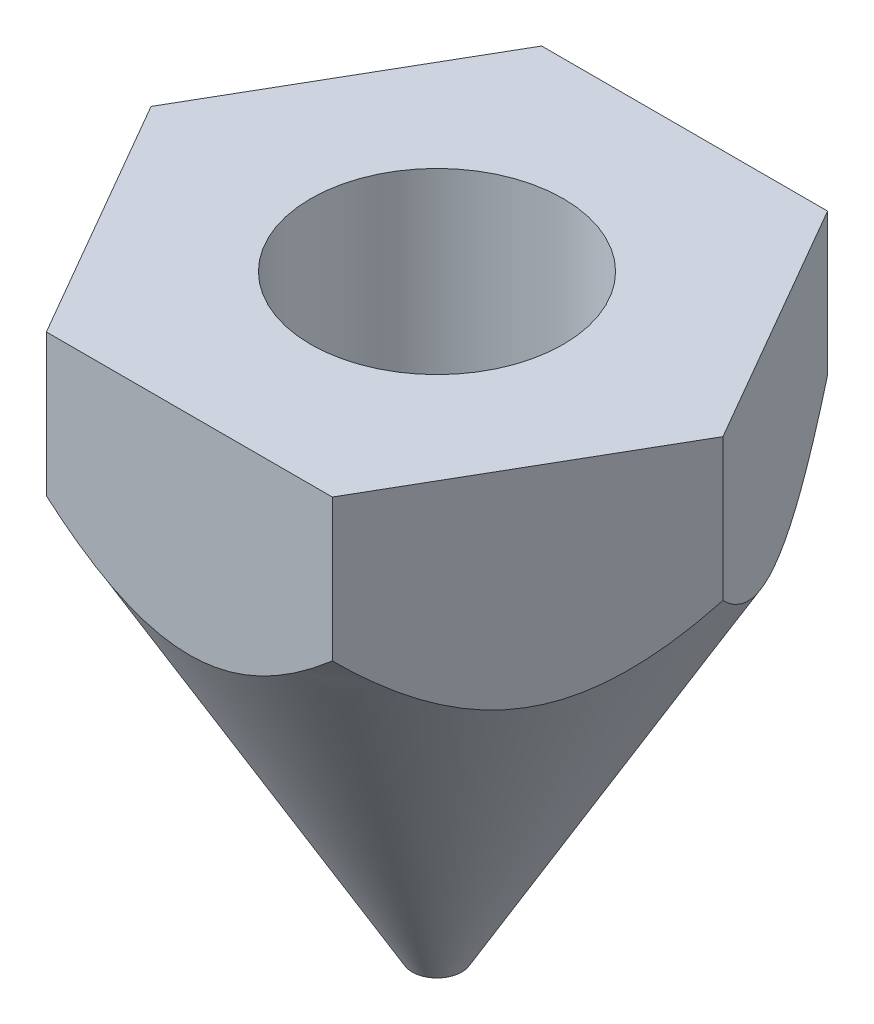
ISO-10303-21;
HEADER;
FILE_DESCRIPTION(('STEP AP214'),'2;1');
FILE_NAME('part.step','',(''),(''),'','','');
FILE_SCHEMA(('AUTOMOTIVE_DESIGN { 1 0 10303 214 1 1 1 1 }'));
ENDSEC;
DATA;
#1=APPLICATION_CONTEXT('core data for automotive mechanical design processes');
#2=APPLICATION_PROTOCOL_DEFINITION('international standard','automotive_design',2000,#1);
#3=PRODUCT_CONTEXT('',#1,'mechanical');
#4=PRODUCT('Part','Part','',(#3));
#5=PRODUCT_RELATED_PRODUCT_CATEGORY('part','',(#4));
#6=PRODUCT_DEFINITION_FORMATION('','',#4);
#7=PRODUCT_DEFINITION_CONTEXT('part definition',#1,'design');
#8=PRODUCT_DEFINITION('design','',#6,#7);
#9=PRODUCT_DEFINITION_SHAPE('','',#8);
#10=(LENGTH_UNIT() NAMED_UNIT(*) SI_UNIT(.MILLI.,.METRE.));
#11=(NAMED_UNIT(*) PLANE_ANGLE_UNIT() SI_UNIT($,.RADIAN.));
#12=(NAMED_UNIT(*) SI_UNIT($,.STERADIAN.) SOLID_ANGLE_UNIT());
#13=UNCERTAINTY_MEASURE_WITH_UNIT(LENGTH_MEASURE(1.E-05),#10,'distance_accuracy_value','');
#14=(GEOMETRIC_REPRESENTATION_CONTEXT(3) GLOBAL_UNCERTAINTY_ASSIGNED_CONTEXT((#13)) GLOBAL_UNIT_ASSIGNED_CONTEXT((#10,
#11,#12)) REPRESENTATION_CONTEXT('',''));
#15=CARTESIAN_POINT('',(0.,0.,0.));
#16=DIRECTION('',(0.,0.,1.));
#17=DIRECTION('',(1.,0.,0.));
#18=AXIS2_PLACEMENT_3D('',#15,#16,#17);
#19=CARTESIAN_POINT('',(0.,-0.527756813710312,0.));
#20=DIRECTION('',(0.,1.,0.));
#21=DIRECTION('',(0.,0.,1.));
#22=AXIS2_PLACEMENT_3D('',#19,#20,#21);
#23=CONICAL_SURFACE('',#22,2.54999999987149,1.04719755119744);
#24=CARTESIAN_POINT('',(0.,-1.884529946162,0.));
#25=DIRECTION('',(0.,1.,0.));
#26=DIRECTION('',(0.,0.,1.));
#27=AXIS2_PLACEMENT_3D('',#24,#25,#26);
#28=CIRCLE('',#27,0.2);
#29=CARTESIAN_POINT('',(0.,-1.884529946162,0.200000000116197));
#30=VERTEX_POINT('',#29);
#31=EDGE_CURVE('E156',#30,#30,#28,.F.);
#32=CARTESIAN_POINT('',(0.,-0.5277568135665,0.));
#33=DIRECTION('',(0.,1.,0.));
#34=DIRECTION('',(0.,0.,1.));
#35=AXIS2_PLACEMENT_3D('',#32,#33,#34);
#36=CIRCLE('',#35,2.55);
#37=CARTESIAN_POINT('',(0.,-0.5277568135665,2.55000000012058));
#38=VERTEX_POINT('',#37);
#39=EDGE_CURVE('E160',#38,#38,#36,.T.);
#40=CARTESIAN_POINT('',(0.,-1.884529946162,0.200000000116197));
#41=CARTESIAN_POINT('',(0.,-1.87039689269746,0.224479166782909));
#42=CARTESIAN_POINT('',(0.,-1.85626383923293,0.248958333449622));
#43=CARTESIAN_POINT('',(0.,-1.82799773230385,0.297916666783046));
#44=CARTESIAN_POINT('',(0.,-1.81386467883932,0.322395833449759));
#45=CARTESIAN_POINT('',(0.,-1.78559857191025,0.371354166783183));
#46=CARTESIAN_POINT('',(0.,-1.77146551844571,0.395833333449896));
#47=CARTESIAN_POINT('',(0.,-1.74319941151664,0.44479166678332));
#48=CARTESIAN_POINT('',(0.,-1.7290663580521,0.469270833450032));
#49=CARTESIAN_POINT('',(0.,-1.70080025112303,0.518229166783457));
#50=CARTESIAN_POINT('',(0.,-1.68666719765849,0.542708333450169));
#51=CARTESIAN_POINT('',(0.,-1.65840109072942,0.591666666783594));
#52=CARTESIAN_POINT('',(0.,-1.64426803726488,0.616145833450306));
#53=CARTESIAN_POINT('',(0.,-1.61600193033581,0.665104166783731));
#54=CARTESIAN_POINT('',(0.,-1.60186887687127,0.689583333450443));
#55=CARTESIAN_POINT('',(0.,-1.5736027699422,0.738541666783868));
#56=CARTESIAN_POINT('',(0.,-1.55946971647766,0.76302083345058));
#57=CARTESIAN_POINT('',(0.,-1.53120360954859,0.811979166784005));
#58=CARTESIAN_POINT('',(0.,-1.51707055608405,0.836458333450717));
#59=CARTESIAN_POINT('',(0.,-1.48880444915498,0.885416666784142));
#60=CARTESIAN_POINT('',(0.,-1.47467139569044,0.909895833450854));
#61=CARTESIAN_POINT('',(0.,-1.44640528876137,0.958854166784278));
#62=CARTESIAN_POINT('',(0.,-1.43227223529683,0.983333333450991));
#63=CARTESIAN_POINT('',(0.,-1.40400612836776,1.03229166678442));
#64=CARTESIAN_POINT('',(0.,-1.38987307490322,1.05677083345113));
#65=CARTESIAN_POINT('',(0.,-1.36160696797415,1.10572916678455));
#66=CARTESIAN_POINT('',(0.,-1.34747391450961,1.13020833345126));
#67=CARTESIAN_POINT('',(0.,-1.31920780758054,1.17916666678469));
#68=CARTESIAN_POINT('',(0.,-1.30507475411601,1.2036458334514));
#69=CARTESIAN_POINT('',(0.,-1.27680864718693,1.25260416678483));
#70=CARTESIAN_POINT('',(0.,-1.2626755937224,1.27708333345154));
#71=CARTESIAN_POINT('',(0.,-1.23440948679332,1.32604166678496));
#72=CARTESIAN_POINT('',(0.,-1.22027643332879,1.35052083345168));
#73=CARTESIAN_POINT('',(0.,-1.19201032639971,1.3994791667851));
#74=CARTESIAN_POINT('',(0.,-1.17787727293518,1.42395833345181));
#75=CARTESIAN_POINT('',(0.,-1.1496111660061,1.47291666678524));
#76=CARTESIAN_POINT('',(0.,-1.13547811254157,1.49739583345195));
#77=CARTESIAN_POINT('',(0.,-1.10721200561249,1.54635416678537));
#78=CARTESIAN_POINT('',(0.,-1.09307895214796,1.57083333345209));
#79=CARTESIAN_POINT('',(0.,-1.06481284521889,1.61979166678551));
#80=CARTESIAN_POINT('',(0.,-1.05067979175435,1.64427083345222));
#81=CARTESIAN_POINT('',(0.,-1.02241368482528,1.69322916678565));
#82=CARTESIAN_POINT('',(0.,-1.00828063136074,1.71770833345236));
#83=CARTESIAN_POINT('',(0.,-0.980014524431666,1.76666666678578));
#84=CARTESIAN_POINT('',(0.,-0.96588147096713,1.7911458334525));
#85=CARTESIAN_POINT('',(0.,-0.937615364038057,1.84010416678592));
#86=CARTESIAN_POINT('',(0.,-0.923482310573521,1.86458333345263));
#87=CARTESIAN_POINT('',(0.,-0.895216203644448,1.91354166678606));
#88=CARTESIAN_POINT('',(0.,-0.881083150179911,1.93802083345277));
#89=CARTESIAN_POINT('',(0.,-0.852817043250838,1.9869791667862));
#90=CARTESIAN_POINT('',(0.,-0.838683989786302,2.01145833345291));
#91=CARTESIAN_POINT('',(0.,-0.810417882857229,2.06041666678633));
#92=CARTESIAN_POINT('',(0.,-0.796284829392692,2.08489583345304));
#93=CARTESIAN_POINT('',(0.,-0.768018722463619,2.13385416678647));
#94=CARTESIAN_POINT('',(0.,-0.753885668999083,2.15833333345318));
#95=CARTESIAN_POINT('',(0.,-0.72561956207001,2.20729166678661));
#96=CARTESIAN_POINT('',(0.,-0.711486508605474,2.23177083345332));
#97=CARTESIAN_POINT('',(0.,-0.683220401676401,2.28072916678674));
#98=CARTESIAN_POINT('',(0.,-0.669087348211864,2.30520833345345));
#99=CARTESIAN_POINT('',(0.,-0.640821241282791,2.35416666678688));
#100=CARTESIAN_POINT('',(0.,-0.626688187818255,2.37864583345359));
#101=CARTESIAN_POINT('',(0.,-0.598422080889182,2.42760416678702));
#102=CARTESIAN_POINT('',(0.,-0.584289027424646,2.45208333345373));
#103=CARTESIAN_POINT('',(0.,-0.556022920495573,2.50104166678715));
#104=CARTESIAN_POINT('',(0.,-0.541889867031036,2.52552083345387));
#105=CARTESIAN_POINT('',(0.,-0.5277568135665,2.55000000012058));
#106=B_SPLINE_CURVE_WITH_KNOTS('',3,(#40,#41,#42,#43,#44,#45,#46,#47,#48,#49,#50,#51,#52,#53,
#54,#55,#56,#57,#58,#59,#60,#61,#62,#63,#64,#65,#66,#67,#68,#69,#70,#71,#72,#73,#74,#75,#76,#77,
#78,#79,#80,#81,#82,#83,#84,#85,#86,#87,#88,#89,#90,#91,#92,#93,#94,#95,#96,#97,#98,#99,#100,
#101,#102,#103,#104,#105),.UNSPECIFIED.,.F.,.F.,(4,2,2,2,2,2,2,2,2,2,2,2,2,2,2,2,2,2,2,2,2,2,2,
2,2,2,2,2,2,2,2,2,4),(0.,0.0847983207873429,0.169596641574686,0.254394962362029,
0.339193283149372,0.423991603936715,0.508789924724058,0.593588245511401,0.678386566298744,
0.763184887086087,0.84798320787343,0.932781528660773,1.01757984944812,1.10237817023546,
1.1871764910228,1.27197481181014,1.35677313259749,1.44157145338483,1.52636977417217,
1.61116809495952,1.69596641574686,1.7807647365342,1.86556305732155,1.95036137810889,
2.03515969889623,2.11995801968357,2.20475634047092,2.28955466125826,2.3743529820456,
2.45915130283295,2.54394962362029,2.62874794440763,2.71354626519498),.UNSPECIFIED.);
#107=EDGE_CURVE('BSEAM17',#30,#38,#106,.T.);
#108=ORIENTED_EDGE('',*,*,#31,.T.);
#109=ORIENTED_EDGE('',*,*,#39,.T.);
#110=ORIENTED_EDGE('',*,*,#107,.T.);
#111=ORIENTED_EDGE('',*,*,#107,.F.);
#112=EDGE_LOOP('',(#108,#110,#109,#111));
#113=FACE_BOUND('',#112,.T.);
#114=ADVANCED_FACE('F17',(#113),#23,.F.);
#115=CARTESIAN_POINT('',(0.,-6.6,0.));
#116=DIRECTION('',(0.,1.,0.));
#117=DIRECTION('',(0.,0.,1.));
#118=AXIS2_PLACEMENT_3D('',#115,#116,#117);
#119=CYLINDRICAL_SURFACE('',#118,2.55);
#120=ORIENTED_EDGE('',*,*,#39,.F.);
#121=EDGE_LOOP('',(#120));
#122=FACE_BOUND('',#121,.T.);
#123=CARTESIAN_POINT('',(0.,6.,0.));
#124=DIRECTION('',(0.,1.,0.));
#125=DIRECTION('',(0.,0.,1.));
#126=AXIS2_PLACEMENT_3D('',#123,#124,#125);
#127=CIRCLE('',#126,2.55);
#128=CARTESIAN_POINT('',(0.,6.,2.55));
#129=VERTEX_POINT('',#128);
#130=EDGE_CURVE('E20',#129,#129,#127,.F.);
#131=ORIENTED_EDGE('',*,*,#130,.F.);
#132=EDGE_LOOP('',(#131));
#133=FACE_BOUND('',#132,.T.);
#134=ADVANCED_FACE('F250',(#122,#133),#119,.F.);
#135=CARTESIAN_POINT('',(0.,6.,0.));
#136=DIRECTION('',(0.,1.,0.));
#137=DIRECTION('',(0.,0.,1.));
#138=AXIS2_PLACEMENT_3D('',#135,#136,#137);
#139=PLANE('',#138);
#140=ORIENTED_EDGE('',*,*,#130,.T.);
#141=EDGE_LOOP('',(#140));
#142=FACE_BOUND('',#141,.T.);
#143=DIRECTION('',(1.,0.,0.));
#144=VECTOR('',#143,1.);
#145=CARTESIAN_POINT('',(-2.886751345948,6.,5.));
#146=LINE('',#145,#144);
#147=CARTESIAN_POINT('',(2.886751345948,6.,5.));
#148=VERTEX_POINT('',#147);
#149=CARTESIAN_POINT('',(-2.88675134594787,6.,4.99999999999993));
#150=VERTEX_POINT('',#149);
#151=EDGE_CURVE('E81',#148,#150,#146,.F.);
#152=ORIENTED_EDGE('',*,*,#151,.F.);
#153=DIRECTION('',(0.500000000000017,0.,-0.866025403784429));
#154=VECTOR('',#153,1.);
#155=CARTESIAN_POINT('',(2.886751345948,6.,5.));
#156=LINE('',#155,#154);
#157=CARTESIAN_POINT('',(5.77350269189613,6.,0.));
#158=VERTEX_POINT('',#157);
#159=EDGE_CURVE('E117',#158,#148,#156,.F.);
#160=ORIENTED_EDGE('',*,*,#159,.F.);
#161=DIRECTION('',(-0.500000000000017,0.,-0.866025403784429));
#162=VECTOR('',#161,1.);
#163=CARTESIAN_POINT('',(5.773502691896,6.,0.));
#164=LINE('',#163,#162);
#165=CARTESIAN_POINT('',(2.88675134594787,6.,-4.99999999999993));
#166=VERTEX_POINT('',#165);
#167=EDGE_CURVE('E124',#166,#158,#164,.F.);
#168=ORIENTED_EDGE('',*,*,#167,.F.);
#169=DIRECTION('',(-1.,0.,0.));
#170=VECTOR('',#169,1.);
#171=CARTESIAN_POINT('',(2.886751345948,6.,-5.));
#172=LINE('',#171,#170);
#173=CARTESIAN_POINT('',(-2.886751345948,6.,-5.));
#174=VERTEX_POINT('',#173);
#175=EDGE_CURVE('E131',#174,#166,#172,.F.);
#176=ORIENTED_EDGE('',*,*,#175,.F.);
#177=DIRECTION('',(-0.500000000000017,0.,0.866025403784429));
#178=VECTOR('',#177,1.);
#179=CARTESIAN_POINT('',(-2.886751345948,6.,-5.));
#180=LINE('',#179,#178);
#181=CARTESIAN_POINT('',(-5.77350269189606,6.,0.));
#182=VERTEX_POINT('',#181);
#183=EDGE_CURVE('E97',#182,#174,#180,.F.);
#184=ORIENTED_EDGE('',*,*,#183,.F.);
#185=DIRECTION('',(0.500000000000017,0.,0.866025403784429));
#186=VECTOR('',#185,1.);
#187=CARTESIAN_POINT('',(-5.773502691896,6.,0.));
#188=LINE('',#187,#186);
#189=EDGE_CURVE('E94',#150,#182,#188,.F.);
#190=ORIENTED_EDGE('',*,*,#189,.F.);
#191=EDGE_LOOP('',(#152,#160,#168,#176,#184,#190));
#192=FACE_BOUND('',#191,.T.);
#193=ADVANCED_FACE('F95',(#142,#192),#139,.T.);
#194=CARTESIAN_POINT('',(-2.886751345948,-6.,-5.));
#195=DIRECTION('',(-0.866025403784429,0.,-0.500000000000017));
#196=DIRECTION('',(-0.500000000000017,0.,0.866025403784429));
#197=AXIS2_PLACEMENT_3D('',#194,#195,#196);
#198=PLANE('',#197);
#199=DIRECTION('',(0.,1.,0.));
#200=VECTOR('',#199,1.);
#201=CARTESIAN_POINT('',(-2.886751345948,-6.,-5.));
#202=LINE('',#201,#200);
#203=CARTESIAN_POINT('',(-2.88675133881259,3.13397458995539,-5.));
#204=VERTEX_POINT('',#203);
#205=EDGE_CURVE('E134',#204,#174,#202,.T.);
#206=ORIENTED_EDGE('',*,*,#205,.F.);
#207=CARTESIAN_POINT('',(-5.77350269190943,3.13397459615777,2.28181177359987E-11));
#208=CARTESIAN_POINT('',(-5.74330935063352,3.08168355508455,-0.052296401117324));
#209=CARTESIAN_POINT('',(-5.7128147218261,3.0300900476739,-0.105114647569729));
#210=CARTESIAN_POINT('',(-5.65115657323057,2.92849255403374,-0.211909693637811));
#211=CARTESIAN_POINT('',(-5.6199928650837,2.8784890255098,-0.265886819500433));
#212=CARTESIAN_POINT('',(-5.52510355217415,2.73069937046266,-0.430239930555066));
#213=CARTESIAN_POINT('',(-5.46028621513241,2.63567137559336,-0.542506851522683));
#214=CARTESIAN_POINT('',(-5.32560574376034,2.45301125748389,-0.775780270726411));
#215=CARTESIAN_POINT('',(-5.25565551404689,2.36563362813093,-0.896937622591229));
#216=CARTESIAN_POINT('',(-5.11196574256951,2.20480810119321,-1.145815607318));
#217=CARTESIAN_POINT('',(-5.0382350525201,2.13132939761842,-1.27352090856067));
#218=CARTESIAN_POINT('',(-4.92137749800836,2.03205360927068,-1.47592413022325));
#219=CARTESIAN_POINT('',(-4.87961849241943,1.99978832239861,-1.54825284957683));
#220=CARTESIAN_POINT('',(-4.7950069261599,1.94151345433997,-1.69480438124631));
#221=CARTESIAN_POINT('',(-4.75215428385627,1.91550434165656,-1.76902733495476));
#222=CARTESIAN_POINT('',(-4.66586691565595,1.87073618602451,-1.91848144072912));
#223=CARTESIAN_POINT('',(-4.62243948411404,1.85192137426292,-1.99369995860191));
#224=CARTESIAN_POINT('',(-4.53493131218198,1.82193201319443,-2.14526855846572));
#225=CARTESIAN_POINT('',(-4.49085069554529,1.81075603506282,-2.22161842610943));
#226=CARTESIAN_POINT('',(-4.40195182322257,1.79642450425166,-2.37559578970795));
#227=CARTESIAN_POINT('',(-4.35713051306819,1.79334377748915,-2.45322857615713));
#228=CARTESIAN_POINT('',(-4.26754050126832,1.79555209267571,-2.6084030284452));
#229=CARTESIAN_POINT('',(-4.22277179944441,1.80084110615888,-2.68594469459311));
#230=CARTESIAN_POINT('',(-4.13356920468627,1.81958218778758,-2.84044812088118));
#231=CARTESIAN_POINT('',(-4.08913625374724,1.83305201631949,-2.91740824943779));
#232=CARTESIAN_POINT('',(-4.00100294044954,1.86763566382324,-3.07005962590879));
#233=CARTESIAN_POINT('',(-3.95730303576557,1.88875408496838,-3.14575008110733));
#234=CARTESIAN_POINT('',(-3.85841334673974,1.94498899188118,-3.31703204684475));
#235=CARTESIAN_POINT('',(-3.80354801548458,1.98238645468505,-3.41206158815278));
#236=CARTESIAN_POINT('',(-3.69570905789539,2.06687223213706,-3.59884414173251));
#237=CARTESIAN_POINT('',(-3.64273662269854,2.11396652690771,-3.6905950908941));
#238=CARTESIAN_POINT('',(-3.53855459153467,2.21631839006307,-3.87104366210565));
#239=CARTESIAN_POINT('',(-3.48735296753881,2.27160811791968,-3.95972747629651));
#240=CARTESIAN_POINT('',(-3.38687589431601,2.38869359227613,-4.13375887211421));
#241=CARTESIAN_POINT('',(-3.33760012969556,2.45048826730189,-4.21910700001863));
#242=CARTESIAN_POINT('',(-3.21831893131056,2.60930689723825,-4.42570809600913));
#243=CARTESIAN_POINT('',(-3.14932143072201,2.70935748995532,-4.54521527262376));
#244=CARTESIAN_POINT('',(-3.04867290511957,2.86510463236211,-4.71954363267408));
#245=CARTESIAN_POINT('',(-3.01577602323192,2.91765297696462,-4.77652270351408));
#246=CARTESIAN_POINT('',(-2.95072554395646,3.02453389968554,-4.88919343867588));
#247=CARTESIAN_POINT('',(-2.91857179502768,3.07886610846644,-4.94488536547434));
#248=CARTESIAN_POINT('',(-2.88675137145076,3.13397455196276,-4.99999995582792));
#249=B_SPLINE_CURVE_WITH_KNOTS('',3,(#207,#208,#209,#210,#211,#212,#213,#214,#215,#216,#217,
#218,#219,#220,#221,#222,#223,#224,#225,#226,#227,#228,#229,#230,#231,#232,#233,#234,#235,#236,
#237,#238,#239,#240,#241,#242,#243,#244,#245,#246,#247,#248),.UNSPECIFIED.,.F.,.F.,(4,2,2,2,2,2,
2,2,2,2,2,2,2,2,2,2,2,2,2,2,4),(0.,0.239630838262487,0.479330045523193,0.961170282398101,
1.4554586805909,1.94863834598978,2.21703664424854,2.48545503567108,2.75174834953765,
3.01799184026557,3.28668775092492,3.55538274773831,3.82466317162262,4.09410589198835,
4.44132290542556,4.78875469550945,5.13758781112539,5.48636355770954,5.99721680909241,
6.2498047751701,6.50234077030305),.UNSPECIFIED.);
#250=CARTESIAN_POINT('',(-5.77350269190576,3.13397459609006,0.));
#251=VERTEX_POINT('',#250);
#252=EDGE_CURVE('E39',#251,#204,#249,.T.);
#253=ORIENTED_EDGE('',*,*,#252,.F.);
#254=DIRECTION('',(0.,1.,0.));
#255=VECTOR('',#254,1.);
#256=CARTESIAN_POINT('',(-5.773502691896,-6.,0.));
#257=LINE('',#256,#255);
#258=EDGE_CURVE('E100',#182,#251,#257,.F.);
#259=ORIENTED_EDGE('',*,*,#258,.F.);
#260=ORIENTED_EDGE('',*,*,#183,.T.);
#261=EDGE_LOOP('',(#206,#253,#259,#260));
#262=FACE_BOUND('',#261,.T.);
#263=ADVANCED_FACE('F227',(#262),#198,.T.);
#264=CARTESIAN_POINT('',(2.886751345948,-6.,-5.));
#265=DIRECTION('',(0.,0.,-1.));
#266=DIRECTION('',(-1.,0.,0.));
#267=AXIS2_PLACEMENT_3D('',#264,#265,#266);
#268=PLANE('',#267);
#269=DIRECTION('',(0.,1.,0.));
#270=VECTOR('',#269,1.);
#271=CARTESIAN_POINT('',(2.88675134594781,-6.,-4.99999999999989));
#272=LINE('',#271,#270);
#273=CARTESIAN_POINT('',(2.88675134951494,3.13397458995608,-4.99999999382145));
#274=VERTEX_POINT('',#273);
#275=EDGE_CURVE('E127',#274,#166,#272,.T.);
#276=ORIENTED_EDGE('',*,*,#275,.F.);
#277=CARTESIAN_POINT('',(-2.88675133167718,3.13397458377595,-5.));
#278=CARTESIAN_POINT('',(-2.82636464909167,3.08168354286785,-5.));
#279=CARTESIAN_POINT('',(-2.76537539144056,3.0300900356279,-5.));
#280=CARTESIAN_POINT('',(-2.64205909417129,2.92849254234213,-5.));
#281=CARTESIAN_POINT('',(-2.5797316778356,2.8784890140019,-5.));
#282=CARTESIAN_POINT('',(-2.38995305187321,2.73069935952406,-5.));
#283=CARTESIAN_POINT('',(-2.2603183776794,2.63567136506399,-5.));
#284=CARTESIAN_POINT('',(-1.99095743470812,2.4530112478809,-5.));
#285=CARTESIAN_POINT('',(-1.85105697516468,2.36563361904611,-5.));
#286=CARTESIAN_POINT('',(-1.56367743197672,2.20480809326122,-5.));
#287=CARTESIAN_POINT('',(-1.4162160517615,2.13132939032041,-5.));
#288=CARTESIAN_POINT('',(-1.18250094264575,2.03205360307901,-5.));
#289=CARTESIAN_POINT('',(-1.09898293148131,1.99978831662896,-5.));
#290=CARTESIAN_POINT('',(-0.929759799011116,1.94151344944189,-5.));
#291=CARTESIAN_POINT('',(-0.844054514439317,1.91550433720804,-5.));
#292=CARTESIAN_POINT('',(-0.671479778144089,1.87073618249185,-5.));
#293=CARTESIAN_POINT('',(-0.584624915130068,1.85192137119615,-5.));
#294=CARTESIAN_POINT('',(-0.409608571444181,1.82193201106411,-5.));
#295=CARTESIAN_POINT('',(-0.321447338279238,1.81075603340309,-5.));
#296=CARTESIAN_POINT('',(-0.143649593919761,1.79642450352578,-5.));
#297=CARTESIAN_POINT('',(-0.0540069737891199,1.79334377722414,-5.));
#298=CARTESIAN_POINT('',(0.125173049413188,1.79555209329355,-5.));
#299=CARTESIAN_POINT('',(0.214710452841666,1.80084110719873,-5.));
#300=CARTESIAN_POINT('',(0.393115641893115,1.81958218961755,-5.));
#301=CARTESIAN_POINT('',(0.481981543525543,1.8330520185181,-5.));
#302=CARTESIAN_POINT('',(0.658248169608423,1.86763566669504,-5.));
#303=CARTESIAN_POINT('',(0.745647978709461,1.88875408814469,-5.));
#304=CARTESIAN_POINT('',(0.943427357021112,1.94498899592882,-5.));
#305=CARTESIAN_POINT('',(1.05315802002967,1.98238645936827,-5.));
#306=CARTESIAN_POINT('',(1.26883593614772,2.06687223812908,-5.));
#307=CARTESIAN_POINT('',(1.37478080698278,2.11396653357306,-5.));
#308=CARTESIAN_POINT('',(1.5831448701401,2.21631839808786,-5.));
#309=CARTESIAN_POINT('',(1.68554811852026,2.27160812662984,-5.));
#310=CARTESIAN_POINT('',(1.88650226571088,2.38869360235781,-5.));
#311=CARTESIAN_POINT('',(1.9850537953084,2.45048827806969,-5.));
#312=CARTESIAN_POINT('',(2.22361618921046,2.60930690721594,-5.));
#313=CARTESIAN_POINT('',(2.36161118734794,2.70935749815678,-5.));
#314=CARTESIAN_POINT('',(2.56290823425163,2.86510463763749,-5.));
#315=CARTESIAN_POINT('',(2.62870199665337,2.91765298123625,-5.));
#316=CARTESIAN_POINT('',(2.75880295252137,3.02453390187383,-5.));
#317=CARTESIAN_POINT('',(2.8231104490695,3.0788661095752,-5.));
#318=CARTESIAN_POINT('',(2.88675129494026,3.13397455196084,-5.));
#319=B_SPLINE_CURVE_WITH_KNOTS('',3,(#277,#278,#279,#280,#281,#282,#283,#284,#285,#286,#287,
#288,#289,#290,#291,#292,#293,#294,#295,#296,#297,#298,#299,#300,#301,#302,#303,#304,#305,#306,
#307,#308,#309,#310,#311,#312,#313,#314,#315,#316,#317,#318),.UNSPECIFIED.,.F.,.F.,(4,2,2,2,2,2,
2,2,2,2,2,2,2,2,2,2,2,2,2,2,4),(0.,0.239630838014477,0.479330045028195,0.961170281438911,
1.45545867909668,1.94863834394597,2.21703664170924,2.4854550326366,2.75174834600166,
3.01799183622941,3.28668774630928,3.55538274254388,3.82466316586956,4.09410588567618,
4.44132290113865,4.78875469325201,5.13758781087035,5.48636355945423,5.99721680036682,
6.24980476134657,6.50234075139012),.UNSPECIFIED.);
#320=EDGE_CURVE('E214',#204,#274,#319,.T.);
#321=ORIENTED_EDGE('',*,*,#320,.F.);
#322=ORIENTED_EDGE('',*,*,#205,.T.);
#323=ORIENTED_EDGE('',*,*,#175,.T.);
#324=EDGE_LOOP('',(#276,#321,#322,#323));
#325=FACE_BOUND('',#324,.T.);
#326=ADVANCED_FACE('F222',(#325),#268,.T.);
#327=CARTESIAN_POINT('',(5.773502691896,-6.,0.));
#328=DIRECTION('',(0.866025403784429,0.,-0.500000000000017));
#329=DIRECTION('',(-0.500000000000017,0.,-0.866025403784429));
#330=AXIS2_PLACEMENT_3D('',#327,#328,#329);
#331=PLANE('',#330);
#332=DIRECTION('',(0.,1.,0.));
#333=VECTOR('',#332,1.);
#334=CARTESIAN_POINT('',(5.77350269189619,-6.,1.11889664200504E-13));
#335=LINE('',#334,#333);
#336=CARTESIAN_POINT('',(5.7735026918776,3.13397459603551,-1.13814647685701E-11));
#337=VERTEX_POINT('',#336);
#338=EDGE_CURVE('E120',#337,#158,#335,.T.);
#339=ORIENTED_EDGE('',*,*,#338,.F.);
#340=CARTESIAN_POINT('',(2.88675135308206,3.13397458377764,-4.99999998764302));
#341=CARTESIAN_POINT('',(2.9169446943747,3.0816835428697,-4.9477035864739));
#342=CARTESIAN_POINT('',(2.94743932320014,3.03009003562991,-4.89488533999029));
#343=CARTESIAN_POINT('',(3.00909747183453,2.92849254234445,-4.78809029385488));
#344=CARTESIAN_POINT('',(3.04026118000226,2.87848901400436,-4.73411316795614));
#345=CARTESIAN_POINT('',(3.13515049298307,2.73069935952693,-4.56976005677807));
#346=CARTESIAN_POINT('',(3.19996783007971,2.63567136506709,-4.45749313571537));
#347=CARTESIAN_POINT('',(3.33464830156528,2.4530112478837,-4.22421971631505));
#348=CARTESIAN_POINT('',(3.40459853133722,2.36563361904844,-4.10306236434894));
#349=CARTESIAN_POINT('',(3.54828830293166,2.20480809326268,-3.85418437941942));
#350=CARTESIAN_POINT('',(3.62201899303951,2.13132939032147,-3.7264790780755));
#351=CARTESIAN_POINT('',(3.73887654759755,2.03205360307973,-3.52407585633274));
#352=CARTESIAN_POINT('',(3.78063555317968,1.99978831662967,-3.45174713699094));
#353=CARTESIAN_POINT('',(3.86524711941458,1.94151344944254,-3.30519560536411));
#354=CARTESIAN_POINT('',(3.90809976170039,1.91550433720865,-3.23097265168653));
#355=CARTESIAN_POINT('',(3.994387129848,1.87073618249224,-3.08151854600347));
#356=CARTESIAN_POINT('',(4.03781456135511,1.85192137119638,-3.00630002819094));
#357=CARTESIAN_POINT('',(4.12532273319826,1.82193201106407,-2.85473142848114));
#358=CARTESIAN_POINT('',(4.16940334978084,1.81075603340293,-2.77838156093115));
#359=CARTESIAN_POINT('',(4.25830222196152,1.79642450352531,-2.62440419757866));
#360=CARTESIAN_POINT('',(4.30312353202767,1.7933437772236,-2.54677141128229));
#361=CARTESIAN_POINT('',(4.39271354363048,1.7955520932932,-2.39159695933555));
#362=CARTESIAN_POINT('',(4.43748224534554,1.80084110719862,-2.31405529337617));
#363=CARTESIAN_POINT('',(4.52668483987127,1.81958218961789,-2.15955186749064));
#364=CARTESIAN_POINT('',(4.57111779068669,1.83305201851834,-2.08259173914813));
#365=CARTESIAN_POINT('',(4.65925110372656,1.86763566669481,-1.92994036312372));
#366=CARTESIAN_POINT('',(4.7029510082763,1.88875408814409,-1.85424990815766));
#367=CARTESIAN_POINT('',(4.80184069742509,1.94498899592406,-1.68296794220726));
#368=CARTESIAN_POINT('',(4.85670602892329,1.98238645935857,-1.58793840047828));
#369=CARTESIAN_POINT('',(4.96454498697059,2.06687223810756,-1.40115584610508));
#370=CARTESIAN_POINT('',(5.01751742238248,2.11396653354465,-1.30940489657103));
#371=CARTESIAN_POINT('',(5.12169945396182,2.21631839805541,-1.12895632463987));
#372=CARTESIAN_POINT('',(5.17290107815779,2.27160812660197,-1.04027251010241));
#373=CARTESIAN_POINT('',(5.27337815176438,2.38869360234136,-0.866241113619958));
#374=CARTESIAN_POINT('',(5.32265391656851,2.45048827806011,-0.780892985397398));
#375=CARTESIAN_POINT('',(5.44193511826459,2.60930691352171,-0.574291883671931));
#376=CARTESIAN_POINT('',(5.51093262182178,2.70935751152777,-0.454784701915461));
#377=CARTESIAN_POINT('',(5.61158115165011,2.8651046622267,-0.280456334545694));
#378=CARTESIAN_POINT('',(5.64447803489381,2.91765300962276,-0.223477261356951));
#379=CARTESIAN_POINT('',(5.70952851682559,3.02453393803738,-0.110806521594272));
#380=CARTESIAN_POINT('',(5.74168226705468,3.07886614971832,-0.0551145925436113));
#381=CARTESIAN_POINT('',(5.77350269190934,3.13397459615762,2.30971017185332E-11));
#382=B_SPLINE_CURVE_WITH_KNOTS('',3,(#340,#341,#342,#343,#344,#345,#346,#347,#348,#349,#350,
#351,#352,#353,#354,#355,#356,#357,#358,#359,#360,#361,#362,#363,#364,#365,#366,#367,#368,#369,
#370,#371,#372,#373,#374,#375,#376,#377,#378,#379,#380,#381),.UNSPECIFIED.,.F.,.F.,(4,2,2,2,2,2,
2,2,2,2,2,2,2,2,2,2,2,2,2,2,4),(0.,0.239630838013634,0.479330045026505,0.961170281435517,
1.45545867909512,1.94863834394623,2.21703664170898,2.48545503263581,2.75174834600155,
3.01799183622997,3.28668774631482,3.55538274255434,3.82466316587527,4.0941058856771,
4.44132290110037,4.78875469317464,5.13758781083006,5.48636355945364,5.9972168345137,
6.24980481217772,6.50234081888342),.UNSPECIFIED.);
#383=EDGE_CURVE('E207',#274,#337,#382,.T.);
#384=ORIENTED_EDGE('',*,*,#383,.F.);
#385=ORIENTED_EDGE('',*,*,#275,.T.);
#386=ORIENTED_EDGE('',*,*,#167,.T.);
#387=EDGE_LOOP('',(#339,#384,#385,#386));
#388=FACE_BOUND('',#387,.T.);
#389=ADVANCED_FACE('F219',(#388),#331,.T.);
#390=CARTESIAN_POINT('',(0.,-6.6,0.));
#391=DIRECTION('',(0.,1.,0.));
#392=DIRECTION('',(0.,0.,1.));
#393=AXIS2_PLACEMENT_3D('',#390,#391,#392);
#394=CYLINDRICAL_SURFACE('',#393,0.2);
#395=ORIENTED_EDGE('',*,*,#31,.F.);
#396=EDGE_LOOP('',(#395));
#397=FACE_BOUND('',#396,.T.);
#398=CARTESIAN_POINT('',(0.,-6.,0.));
#399=DIRECTION('',(0.,1.,0.));
#400=DIRECTION('',(0.,0.,1.));
#401=AXIS2_PLACEMENT_3D('',#398,#399,#400);
#402=CIRCLE('',#401,0.2);
#403=CARTESIAN_POINT('',(0.,-6.,0.2));
#404=VERTEX_POINT('',#403);
#405=EDGE_CURVE('E203',#404,#404,#402,.F.);
#406=ORIENTED_EDGE('',*,*,#405,.T.);
#407=EDGE_LOOP('',(#406));
#408=FACE_BOUND('',#407,.T.);
#409=ADVANCED_FACE('F193',(#397,#408),#394,.F.);
#410=CARTESIAN_POINT('',(2.886751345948,-6.,5.));
#411=DIRECTION('',(0.866025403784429,0.,0.500000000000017));
#412=DIRECTION('',(0.500000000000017,0.,-0.866025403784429));
#413=AXIS2_PLACEMENT_3D('',#410,#411,#412);
#414=PLANE('',#413);
#415=DIRECTION('',(0.,1.,0.));
#416=VECTOR('',#415,1.);
#417=CARTESIAN_POINT('',(2.886751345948,-6.,5.));
#418=LINE('',#417,#416);
#419=CARTESIAN_POINT('',(2.88675133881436,3.13397458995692,5.));
#420=VERTEX_POINT('',#419);
#421=EDGE_CURVE('E88',#420,#148,#418,.T.);
#422=ORIENTED_EDGE('',*,*,#421,.F.);
#423=CARTESIAN_POINT('',(5.77350269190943,3.13397459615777,-2.2818433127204E-11));
#424=CARTESIAN_POINT('',(5.74330935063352,3.08168355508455,0.052296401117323));
#425=CARTESIAN_POINT('',(5.7128147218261,3.0300900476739,0.105114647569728));
#426=CARTESIAN_POINT('',(5.65115657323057,2.92849255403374,0.211909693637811));
#427=CARTESIAN_POINT('',(5.6199928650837,2.8784890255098,0.265886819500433));
#428=CARTESIAN_POINT('',(5.52510355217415,2.73069937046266,0.430239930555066));
#429=CARTESIAN_POINT('',(5.46028621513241,2.63567137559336,0.542506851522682));
#430=CARTESIAN_POINT('',(5.32560574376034,2.45301125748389,0.775780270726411));
#431=CARTESIAN_POINT('',(5.25565551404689,2.36563362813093,0.896937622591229));
#432=CARTESIAN_POINT('',(5.11196574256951,2.20480810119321,1.145815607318));
#433=CARTESIAN_POINT('',(5.0382350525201,2.13132939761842,1.27352090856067));
#434=CARTESIAN_POINT('',(4.92137749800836,2.03205360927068,1.47592413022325));
#435=CARTESIAN_POINT('',(4.87961849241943,1.99978832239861,1.54825284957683));
#436=CARTESIAN_POINT('',(4.7950069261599,1.94151345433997,1.69480438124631));
#437=CARTESIAN_POINT('',(4.75215428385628,1.91550434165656,1.76902733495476));
#438=CARTESIAN_POINT('',(4.66586691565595,1.87073618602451,1.91848144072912));
#439=CARTESIAN_POINT('',(4.62243948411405,1.85192137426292,1.99369995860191));
#440=CARTESIAN_POINT('',(4.53493131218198,1.82193201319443,2.14526855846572));
#441=CARTESIAN_POINT('',(4.49085069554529,1.81075603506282,2.22161842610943));
#442=CARTESIAN_POINT('',(4.40195182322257,1.79642450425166,2.37559578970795));
#443=CARTESIAN_POINT('',(4.3571305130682,1.79334377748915,2.45322857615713));
#444=CARTESIAN_POINT('',(4.26754050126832,1.79555209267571,2.6084030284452));
#445=CARTESIAN_POINT('',(4.22277179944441,1.80084110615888,2.68594469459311));
#446=CARTESIAN_POINT('',(4.13356920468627,1.81958218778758,2.84044812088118));
#447=CARTESIAN_POINT('',(4.08913625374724,1.83305201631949,2.91740824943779));
#448=CARTESIAN_POINT('',(4.00100294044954,1.86763566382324,3.07005962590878));
#449=CARTESIAN_POINT('',(3.95730303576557,1.88875408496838,3.14575008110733));
#450=CARTESIAN_POINT('',(3.85841334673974,1.94498899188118,3.31703204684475));
#451=CARTESIAN_POINT('',(3.80354801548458,1.98238645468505,3.41206158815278));
#452=CARTESIAN_POINT('',(3.69570905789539,2.06687223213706,3.59884414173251));
#453=CARTESIAN_POINT('',(3.64273662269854,2.11396652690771,3.6905950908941));
#454=CARTESIAN_POINT('',(3.53855459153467,2.21631839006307,3.87104366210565));
#455=CARTESIAN_POINT('',(3.48735296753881,2.27160811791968,3.95972747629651));
#456=CARTESIAN_POINT('',(3.38687589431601,2.38869359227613,4.13375887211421));
#457=CARTESIAN_POINT('',(3.33760012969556,2.45048826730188,4.21910700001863));
#458=CARTESIAN_POINT('',(3.21831893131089,2.60930689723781,4.42570809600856));
#459=CARTESIAN_POINT('',(3.14932143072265,2.70935748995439,4.54521527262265));
#460=CARTESIAN_POINT('',(3.04867290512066,2.86510463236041,4.7195436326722));
#461=CARTESIAN_POINT('',(3.01577602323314,2.91765297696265,4.77652270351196));
#462=CARTESIAN_POINT('',(2.95072554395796,3.02453389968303,4.88919343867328));
#463=CARTESIAN_POINT('',(2.91857179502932,3.07886610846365,4.9448853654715));
#464=CARTESIAN_POINT('',(2.88675137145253,3.13397455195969,4.99999995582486));
#465=B_SPLINE_CURVE_WITH_KNOTS('',3,(#423,#424,#425,#426,#427,#428,#429,#430,#431,#432,#433,
#434,#435,#436,#437,#438,#439,#440,#441,#442,#443,#444,#445,#446,#447,#448,#449,#450,#451,#452,
#453,#454,#455,#456,#457,#458,#459,#460,#461,#462,#463,#464),.UNSPECIFIED.,.F.,.F.,(4,2,2,2,2,2,
2,2,2,2,2,2,2,2,2,2,2,2,2,2,4),(0.,0.239630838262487,0.479330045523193,0.961170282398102,
1.4554586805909,1.94863834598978,2.21703664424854,2.48545503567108,2.75174834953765,
3.01799184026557,3.28668775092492,3.5553827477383,3.82466317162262,4.09410589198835,
4.44132290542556,4.78875469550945,5.13758781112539,5.48636355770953,5.99721680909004,
6.24980477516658,6.50234077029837),.UNSPECIFIED.);
#466=EDGE_CURVE('E196',#337,#420,#465,.T.);
#467=ORIENTED_EDGE('',*,*,#466,.F.);
#468=ORIENTED_EDGE('',*,*,#338,.T.);
#469=ORIENTED_EDGE('',*,*,#159,.T.);
#470=EDGE_LOOP('',(#422,#467,#468,#469));
#471=FACE_BOUND('',#470,.T.);
#472=ADVANCED_FACE('F189',(#471),#414,.T.);
#473=CARTESIAN_POINT('',(-2.886751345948,-6.,5.));
#474=DIRECTION('',(0.,0.,1.));
#475=DIRECTION('',(1.,0.,0.));
#476=AXIS2_PLACEMENT_3D('',#473,#474,#475);
#477=PLANE('',#476);
#478=DIRECTION('',(0.,1.,0.));
#479=VECTOR('',#478,1.);
#480=CARTESIAN_POINT('',(-2.88675134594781,-6.,4.99999999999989));
#481=LINE('',#480,#479);
#482=CARTESIAN_POINT('',(-2.88675134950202,3.13397458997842,4.99999999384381));
#483=VERTEX_POINT('',#482);
#484=EDGE_CURVE('E86',#483,#150,#481,.T.);
#485=ORIENTED_EDGE('',*,*,#484,.F.);
#486=CARTESIAN_POINT('',(2.88675133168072,3.13397458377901,5.));
#487=CARTESIAN_POINT('',(2.82636464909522,3.08168354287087,5.));
#488=CARTESIAN_POINT('',(2.76537539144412,3.03009003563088,5.));
#489=CARTESIAN_POINT('',(2.64205909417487,2.92849254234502,5.));
#490=CARTESIAN_POINT('',(2.57973167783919,2.87848901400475,5.));
#491=CARTESIAN_POINT('',(2.38995305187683,2.73069935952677,5.));
#492=CARTESIAN_POINT('',(2.26031837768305,2.6356713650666,5.));
#493=CARTESIAN_POINT('',(1.99095743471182,2.45301124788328,5.));
#494=CARTESIAN_POINT('',(1.85105697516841,2.36563361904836,5.));
#495=CARTESIAN_POINT('',(1.56367743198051,2.20480809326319,5.));
#496=CARTESIAN_POINT('',(1.41621605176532,2.13132939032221,5.));
#497=CARTESIAN_POINT('',(1.18250094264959,2.03205360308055,5.));
#498=CARTESIAN_POINT('',(1.09898293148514,1.99978831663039,5.));
#499=CARTESIAN_POINT('',(0.929759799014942,1.9415134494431,5.));
#500=CARTESIAN_POINT('',(0.844054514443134,1.91550433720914,5.));
#501=CARTESIAN_POINT('',(0.671479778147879,1.87073618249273,5.));
#502=CARTESIAN_POINT('',(0.584624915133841,1.85192137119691,5.));
#503=CARTESIAN_POINT('',(0.40960857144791,1.82193201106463,5.));
#504=CARTESIAN_POINT('',(0.32144733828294,1.8107560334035,5.));
#505=CARTESIAN_POINT('',(0.14364959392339,1.79642450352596,5.));
#506=CARTESIAN_POINT('',(0.0540069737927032,1.7933437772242,5.));
#507=CARTESIAN_POINT('',(-0.125173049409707,1.79555209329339,5.));
#508=CARTESIAN_POINT('',(-0.21471045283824,1.80084110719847,5.));
#509=CARTESIAN_POINT('',(-0.393115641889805,1.8195821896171,5.));
#510=CARTESIAN_POINT('',(-0.481981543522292,1.83305201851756,5.));
#511=CARTESIAN_POINT('',(-0.658248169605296,1.86763566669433,5.));
#512=CARTESIAN_POINT('',(-0.745647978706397,1.88875408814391,5.));
#513=CARTESIAN_POINT('',(-0.943427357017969,1.94498899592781,5.));
#514=CARTESIAN_POINT('',(-1.05315802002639,1.9823864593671,5.));
#515=CARTESIAN_POINT('',(-1.26883593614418,2.06687223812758,5.));
#516=CARTESIAN_POINT('',(-1.37478080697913,2.11396653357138,5.));
#517=CARTESIAN_POINT('',(-1.58314487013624,2.21631839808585,5.));
#518=CARTESIAN_POINT('',(-1.68554811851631,2.27160812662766,5.));
#519=CARTESIAN_POINT('',(-1.88650226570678,2.3886936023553,5.));
#520=CARTESIAN_POINT('',(-1.98505379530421,2.45048827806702,5.));
#521=CARTESIAN_POINT('',(-2.22361618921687,2.60930690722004,5.));
#522=CARTESIAN_POINT('',(-2.36161118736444,2.70935749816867,5.));
#523=CARTESIAN_POINT('',(-2.56290823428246,2.86510463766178,5.));
#524=CARTESIAN_POINT('',(-2.6287019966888,2.91765298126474,5.));
#525=CARTESIAN_POINT('',(-2.75880295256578,3.02453390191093,5.));
#526=CARTESIAN_POINT('',(-2.8231104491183,3.07886610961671,5.));
#527=CARTESIAN_POINT('',(-2.88675129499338,3.13397455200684,5.));
#528=B_SPLINE_CURVE_WITH_KNOTS('',3,(#486,#487,#488,#489,#490,#491,#492,#493,#494,#495,#496,
#497,#498,#499,#500,#501,#502,#503,#504,#505,#506,#507,#508,#509,#510,#511,#512,#513,#514,#515,
#516,#517,#518,#519,#520,#521,#522,#523,#524,#525,#526,#527),.UNSPECIFIED.,.F.,.F.,(4,2,2,2,2,2,
2,2,2,2,2,2,2,2,2,2,2,2,2,2,4),(0.,0.239630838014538,0.479330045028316,0.961170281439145,
1.45545867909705,1.94863834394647,2.21703664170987,2.48545503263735,2.75174834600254,
3.01799183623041,3.28668774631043,3.55538274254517,3.82466316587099,4.09410588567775,
4.44132290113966,4.78875469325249,5.13758781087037,5.4863635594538,5.99721680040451,
6.24980476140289,6.50234075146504),.UNSPECIFIED.);
#529=EDGE_CURVE('E174',#420,#483,#528,.T.);
#530=ORIENTED_EDGE('',*,*,#529,.F.);
#531=ORIENTED_EDGE('',*,*,#421,.T.);
#532=ORIENTED_EDGE('',*,*,#151,.T.);
#533=EDGE_LOOP('',(#485,#530,#531,#532));
#534=FACE_BOUND('',#533,.T.);
#535=ADVANCED_FACE('F83',(#534),#477,.T.);
#536=CARTESIAN_POINT('',(-5.773502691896,-6.,0.));
#537=DIRECTION('',(-0.866025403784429,0.,0.500000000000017));
#538=DIRECTION('',(0.500000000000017,0.,0.866025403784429));
#539=AXIS2_PLACEMENT_3D('',#536,#537,#538);
#540=PLANE('',#539);
#541=ORIENTED_EDGE('',*,*,#258,.T.);
#542=CARTESIAN_POINT('',(-2.88675135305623,3.13397458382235,4.99999998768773));
#543=CARTESIAN_POINT('',(-2.91694469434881,3.08168354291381,4.94770358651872));
#544=CARTESIAN_POINT('',(-2.94743932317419,3.0300900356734,4.89488534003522));
#545=CARTESIAN_POINT('',(-3.00909747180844,2.92849254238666,4.78809029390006));
#546=CARTESIAN_POINT('',(-3.04026117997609,2.87848901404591,4.73411316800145));
#547=CARTESIAN_POINT('',(-3.13515049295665,2.73069935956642,4.56976005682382));
#548=CARTESIAN_POINT('',(-3.19996783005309,2.63567136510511,4.45749313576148));
#549=CARTESIAN_POINT('',(-3.33464830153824,2.45301124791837,4.22421971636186));
#550=CARTESIAN_POINT('',(-3.40459853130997,2.36563361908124,4.10306236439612));
#551=CARTESIAN_POINT('',(-3.54828830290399,2.20480809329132,3.85418437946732));
#552=CARTESIAN_POINT('',(-3.62201899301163,2.13132939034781,3.72647907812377));
#553=CARTESIAN_POINT('',(-3.73887654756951,2.03205360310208,3.5240758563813));
#554=CARTESIAN_POINT('',(-3.78063555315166,1.9997883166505,3.45174713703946));
#555=CARTESIAN_POINT('',(-3.86524711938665,1.94151344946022,3.30519560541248));
#556=CARTESIAN_POINT('',(-3.90809976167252,1.91550433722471,3.23097265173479));
#557=CARTESIAN_POINT('',(-3.99438712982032,1.87073618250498,3.0815185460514));
#558=CARTESIAN_POINT('',(-4.03781456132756,1.85192137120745,3.00630002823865));
#559=CARTESIAN_POINT('',(-4.12532273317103,1.82193201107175,2.85473142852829));
#560=CARTESIAN_POINT('',(-4.16940334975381,1.81075603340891,2.77838156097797));
#561=CARTESIAN_POINT('',(-4.258302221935,1.79642450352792,2.62440419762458));
#562=CARTESIAN_POINT('',(-4.30312353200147,1.79334377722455,2.54677141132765));
#563=CARTESIAN_POINT('',(-4.392713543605,1.79555209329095,2.39159695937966));
#564=CARTESIAN_POINT('',(-4.43748224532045,1.80084110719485,2.31405529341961));
#565=CARTESIAN_POINT('',(-4.52668483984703,1.81958218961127,2.15955186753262));
#566=CARTESIAN_POINT('',(-4.57111779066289,1.83305201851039,2.08259173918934));
#567=CARTESIAN_POINT('',(-4.65925110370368,1.86763566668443,1.92994036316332));
#568=CARTESIAN_POINT('',(-4.7029510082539,1.8887540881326,1.85424990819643));
#569=CARTESIAN_POINT('',(-4.80184069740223,1.94498899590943,1.68296794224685));
#570=CARTESIAN_POINT('',(-4.85670602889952,1.98238645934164,1.58793840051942));
#571=CARTESIAN_POINT('',(-4.96454498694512,2.0668722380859,1.40115584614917));
#572=CARTESIAN_POINT('',(-5.01751742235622,2.11396653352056,1.3094048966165));
#573=CARTESIAN_POINT('',(-5.12169945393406,2.21631839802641,1.12895632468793));
#574=CARTESIAN_POINT('',(-5.17290107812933,2.2716081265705,1.04027251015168));
#575=CARTESIAN_POINT('',(-5.27337815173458,2.38869360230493,0.866241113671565));
#576=CARTESIAN_POINT('',(-5.32265391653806,2.4504882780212,0.78089298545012));
#577=CARTESIAN_POINT('',(-5.44193511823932,2.60930691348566,0.574291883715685));
#578=CARTESIAN_POINT('',(-5.510932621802,2.70935751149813,0.45478470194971));
#579=CARTESIAN_POINT('',(-5.61158115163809,2.86510466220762,0.280456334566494));
#580=CARTESIAN_POINT('',(-5.64447803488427,2.9176530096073,0.223477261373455));
#581=CARTESIAN_POINT('',(-5.70952851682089,3.02453393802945,0.110806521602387));
#582=CARTESIAN_POINT('',(-5.74168226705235,3.07886614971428,0.0551145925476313));
#583=CARTESIAN_POINT('',(-5.77350269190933,3.13397459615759,-2.30896511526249E-11));
#584=B_SPLINE_CURVE_WITH_KNOTS('',3,(#542,#543,#544,#545,#546,#547,#548,#549,#550,#551,#552,
#553,#554,#555,#556,#557,#558,#559,#560,#561,#562,#563,#564,#565,#566,#567,#568,#569,#570,#571,
#572,#573,#574,#575,#576,#577,#578,#579,#580,#581,#582,#583),.UNSPECIFIED.,.F.,.F.,(4,2,2,2,2,2,
2,2,2,2,2,2,2,2,2,2,2,2,2,2,4),(0.,0.239630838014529,0.479330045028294,0.96117028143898,
1.45545867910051,1.94863834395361,2.21703664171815,2.48545503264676,2.75174834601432,
3.01799183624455,3.28668774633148,3.55538274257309,3.82466316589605,4.09410588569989,
4.44132290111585,4.78875469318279,5.13758781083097,5.48636355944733,5.99721683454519,
6.24980481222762,6.5023408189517),.UNSPECIFIED.);
#585=EDGE_CURVE('E27',#483,#251,#584,.T.);
#586=ORIENTED_EDGE('',*,*,#585,.F.);
#587=ORIENTED_EDGE('',*,*,#484,.T.);
#588=ORIENTED_EDGE('',*,*,#189,.T.);
#589=EDGE_LOOP('',(#541,#586,#587,#588));
#590=FACE_BOUND('',#589,.T.);
#591=ADVANCED_FACE('F102',(#590),#540,.T.);
#592=CARTESIAN_POINT('',(0.,-6.,0.));
#593=DIRECTION('',(0.,1.,0.));
#594=DIRECTION('',(0.,0.,1.));
#595=AXIS2_PLACEMENT_3D('',#592,#593,#594);
#596=PLANE('',#595);
#597=ORIENTED_EDGE('',*,*,#405,.F.);
#598=EDGE_LOOP('',(#597));
#599=FACE_BOUND('',#598,.T.);
#600=CARTESIAN_POINT('',(0.,-6.00000000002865,0.));
#601=DIRECTION('',(0.,1.,0.));
#602=DIRECTION('',(0.,0.,1.));
#603=AXIS2_PLACEMENT_3D('',#600,#601,#602);
#604=CIRCLE('',#603,0.500000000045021);
#605=CARTESIAN_POINT('',(0.,-6.00000000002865,0.500000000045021));
#606=VERTEX_POINT('',#605);
#607=EDGE_CURVE('E11',#606,#606,#604,.T.);
#608=ORIENTED_EDGE('',*,*,#607,.F.);
#609=EDGE_LOOP('',(#608));
#610=FACE_BOUND('',#609,.T.);
#611=ADVANCED_FACE('F185',(#599,#610),#596,.F.);
#612=CARTESIAN_POINT('',(0.,3.1887784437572,0.));
#613=DIRECTION('',(0.,1.,0.));
#614=DIRECTION('',(0.,0.,1.));
#615=AXIS2_PLACEMENT_3D('',#612,#613,#614);
#616=CONICAL_SURFACE('',#615,5.8051437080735,0.523598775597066);
#617=ORIENTED_EDGE('',*,*,#383,.T.);
#618=ORIENTED_EDGE('',*,*,#466,.T.);
#619=ORIENTED_EDGE('',*,*,#529,.T.);
#620=ORIENTED_EDGE('',*,*,#585,.T.);
#621=ORIENTED_EDGE('',*,*,#252,.T.);
#622=ORIENTED_EDGE('',*,*,#320,.T.);
#623=EDGE_LOOP('',(#617,#618,#619,#620,#621,#622));
#624=FACE_BOUND('',#623,.T.);
#625=ORIENTED_EDGE('',*,*,#607,.T.);
#626=EDGE_LOOP('',(#625));
#627=FACE_BOUND('',#626,.T.);
#628=ADVANCED_FACE('F180',(#624,#627),#616,.T.);
#629=CLOSED_SHELL('',(#114,#134,#193,#263,#326,#389,#409,#472,#535,#591,#611,#628));
#630=MANIFOLD_SOLID_BREP('B1',#629);
#631=ADVANCED_BREP_SHAPE_REPRESENTATION('',(#18,#630),#14);
#632=SHAPE_DEFINITION_REPRESENTATION(#9,#631);
ENDSEC;
END-ISO-10303-21;
